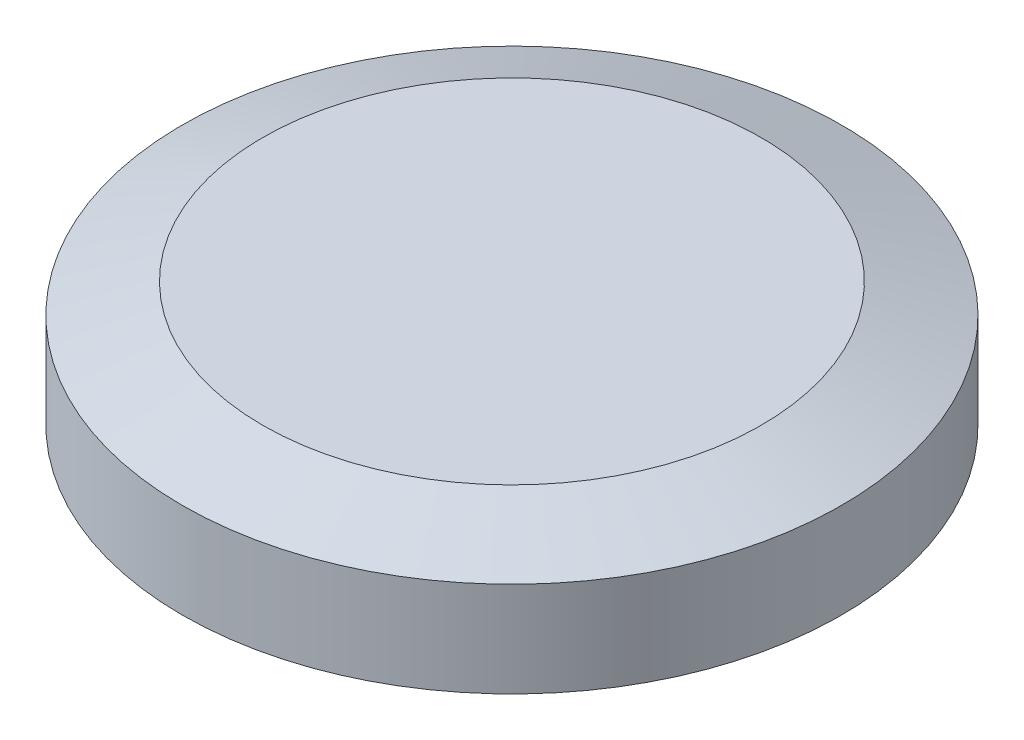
ISO-10303-21;
HEADER;
FILE_DESCRIPTION(('STEP AP214'),'2;1');
FILE_NAME('part.step','',(''),(''),'','','');
FILE_SCHEMA(('AUTOMOTIVE_DESIGN { 1 0 10303 214 1 1 1 1 }'));
ENDSEC;
DATA;
#1=APPLICATION_CONTEXT('core data for automotive mechanical design processes');
#2=APPLICATION_PROTOCOL_DEFINITION('international standard','automotive_design',2000,#1);
#3=PRODUCT_CONTEXT('',#1,'mechanical');
#4=PRODUCT('Part','Part','',(#3));
#5=PRODUCT_RELATED_PRODUCT_CATEGORY('part','',(#4));
#6=PRODUCT_DEFINITION_FORMATION('','',#4);
#7=PRODUCT_DEFINITION_CONTEXT('part definition',#1,'design');
#8=PRODUCT_DEFINITION('design','',#6,#7);
#9=PRODUCT_DEFINITION_SHAPE('','',#8);
#10=(LENGTH_UNIT() NAMED_UNIT(*) SI_UNIT(.MILLI.,.METRE.));
#11=(NAMED_UNIT(*) PLANE_ANGLE_UNIT() SI_UNIT($,.RADIAN.));
#12=(NAMED_UNIT(*) SI_UNIT($,.STERADIAN.) SOLID_ANGLE_UNIT());
#13=UNCERTAINTY_MEASURE_WITH_UNIT(LENGTH_MEASURE(1.E-05),#10,'distance_accuracy_value','');
#14=(GEOMETRIC_REPRESENTATION_CONTEXT(3) GLOBAL_UNCERTAINTY_ASSIGNED_CONTEXT((#13)) GLOBAL_UNIT_ASSIGNED_CONTEXT((#10,
#11,#12)) REPRESENTATION_CONTEXT('',''));
#15=CARTESIAN_POINT('',(0.,0.,0.));
#16=DIRECTION('',(0.,0.,1.));
#17=DIRECTION('',(1.,0.,0.));
#18=AXIS2_PLACEMENT_3D('',#15,#16,#17);
#19=CARTESIAN_POINT('',(0.,0.,0.));
#20=DIRECTION('',(0.,-1.,0.));
#21=DIRECTION('',(0.,0.,-1.));
#22=AXIS2_PLACEMENT_3D('',#19,#20,#21);
#23=PLANE('',#22);
#24=CARTESIAN_POINT('',(0.,0.,0.));
#25=DIRECTION('',(0.,1.,0.));
#26=DIRECTION('',(0.,0.,1.));
#27=AXIS2_PLACEMENT_3D('',#24,#25,#26);
#28=CIRCLE('',#27,8.27586676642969);
#29=CARTESIAN_POINT('',(0.,0.,8.27586676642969));
#30=VERTEX_POINT('',#29);
#31=EDGE_CURVE('E10',#30,#30,#28,.T.);
#32=ORIENTED_EDGE('',*,*,#31,.F.);
#33=EDGE_LOOP('',(#32));
#34=FACE_BOUND('',#33,.T.);
#35=ADVANCED_FACE('F31',(#34),#23,.T.);
#36=CARTESIAN_POINT('',(0.,0.787399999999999,0.));
#37=DIRECTION('',(0.,1.,0.));
#38=DIRECTION('',(0.,0.,1.));
#39=AXIS2_PLACEMENT_3D('',#36,#37,#38);
#40=TOROIDAL_SURFACE('',#39,8.27586676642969,0.787399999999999);
#41=ORIENTED_EDGE('',*,*,#31,.T.);
#42=EDGE_LOOP('',(#41));
#43=FACE_BOUND('',#42,.T.);
#44=CARTESIAN_POINT('',(0.,0.230624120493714,0.));
#45=DIRECTION('',(0.,1.,0.));
#46=DIRECTION('',(0.,0.,1.));
#47=AXIS2_PLACEMENT_3D('',#44,#45,#46);
#48=CIRCLE('',#47,8.83264264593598);
#49=CARTESIAN_POINT('',(0.,0.230624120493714,8.83264264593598));
#50=VERTEX_POINT('',#49);
#51=EDGE_CURVE('E37',#50,#50,#48,.T.);
#52=ORIENTED_EDGE('',*,*,#51,.F.);
#53=EDGE_LOOP('',(#52));
#54=FACE_BOUND('',#53,.T.);
#55=ADVANCED_FACE('F79',(#43,#54),#40,.T.);
#56=CARTESIAN_POINT('',(0.,0.982285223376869,0.));
#57=DIRECTION('',(0.,1.,0.));
#58=DIRECTION('',(0.,0.,1.));
#59=AXIS2_PLACEMENT_3D('',#56,#57,#58);
#60=CONICAL_SURFACE('',#59,9.58430374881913,0.785398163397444);
#61=ORIENTED_EDGE('',*,*,#51,.T.);
#62=EDGE_LOOP('',(#61));
#63=FACE_BOUND('',#62,.T.);
#64=CARTESIAN_POINT('',(0.,0.982285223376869,0.));
#65=DIRECTION('',(0.,1.,0.));
#66=DIRECTION('',(0.,0.,1.));
#67=AXIS2_PLACEMENT_3D('',#64,#65,#66);
#68=CIRCLE('',#67,9.58430374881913);
#69=CARTESIAN_POINT('',(0.,0.982285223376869,9.58430374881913));
#70=VERTEX_POINT('',#69);
#71=EDGE_CURVE('E41',#70,#70,#68,.T.);
#72=ORIENTED_EDGE('',*,*,#71,.F.);
#73=EDGE_LOOP('',(#72));
#74=FACE_BOUND('',#73,.T.);
#75=ADVANCED_FACE('F84',(#63,#74),#60,.T.);
#76=CARTESIAN_POINT('',(0.,0.431799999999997,0.));
#77=DIRECTION('',(0.,1.,0.));
#78=DIRECTION('',(0.,0.,1.));
#79=AXIS2_PLACEMENT_3D('',#76,#77,#78);
#80=TOROIDAL_SURFACE('',#79,10.1473,0.7874);
#81=ORIENTED_EDGE('',*,*,#71,.T.);
#82=EDGE_LOOP('',(#81));
#83=FACE_BOUND('',#82,.T.);
#84=CARTESIAN_POINT('',(0.,0.572649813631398,0.));
#85=DIRECTION('',(0.,1.,0.));
#86=DIRECTION('',(0.,0.,1.));
#87=AXIS2_PLACEMENT_3D('',#84,#85,#86);
#88=CIRCLE('',#87,10.922);
#89=CARTESIAN_POINT('',(0.,0.572649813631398,10.922));
#90=VERTEX_POINT('',#89);
#91=EDGE_CURVE('E45',#90,#90,#88,.T.);
#92=ORIENTED_EDGE('',*,*,#91,.F.);
#93=EDGE_LOOP('',(#92));
#94=FACE_BOUND('',#93,.T.);
#95=ADVANCED_FACE('F88',(#83,#94),#80,.F.);
#96=CARTESIAN_POINT('',(0.,3.8608,0.));
#97=DIRECTION('',(0.,1.,0.));
#98=DIRECTION('',(0.,0.,1.));
#99=AXIS2_PLACEMENT_3D('',#96,#97,#98);
#100=CYLINDRICAL_SURFACE('',#99,10.922);
#101=ORIENTED_EDGE('',*,*,#91,.T.);
#102=EDGE_LOOP('',(#101));
#103=FACE_BOUND('',#102,.T.);
#104=CARTESIAN_POINT('',(0.,-0.889000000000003,0.));
#105=DIRECTION('',(0.,1.,0.));
#106=DIRECTION('',(0.,0.,1.));
#107=AXIS2_PLACEMENT_3D('',#104,#105,#106);
#108=CIRCLE('',#107,10.922);
#109=CARTESIAN_POINT('',(0.,-0.889000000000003,10.922));
#110=VERTEX_POINT('',#109);
#111=EDGE_CURVE('E50',#110,#110,#108,.T.);
#112=ORIENTED_EDGE('',*,*,#111,.F.);
#113=EDGE_LOOP('',(#112));
#114=FACE_BOUND('',#113,.T.);
#115=ADVANCED_FACE('F94',(#103,#114),#100,.F.);
#116=CARTESIAN_POINT('',(-12.5984,-0.889000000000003,0.));
#117=DIRECTION('',(0.,-1.,0.));
#118=DIRECTION('',(0.,0.,-1.));
#119=AXIS2_PLACEMENT_3D('',#116,#117,#118);
#120=PLANE('',#119);
#121=ORIENTED_EDGE('',*,*,#111,.T.);
#122=EDGE_LOOP('',(#121));
#123=FACE_BOUND('',#122,.T.);
#124=CARTESIAN_POINT('',(0.,-0.889000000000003,0.));
#125=DIRECTION('',(0.,1.,0.));
#126=DIRECTION('',(0.,0.,1.));
#127=AXIS2_PLACEMENT_3D('',#124,#125,#126);
#128=CIRCLE('',#127,12.5984);
#129=CARTESIAN_POINT('',(0.,-0.889000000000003,12.5984));
#130=VERTEX_POINT('',#129);
#131=EDGE_CURVE('E53',#130,#130,#128,.T.);
#132=ORIENTED_EDGE('',*,*,#131,.F.);
#133=EDGE_LOOP('',(#132));
#134=FACE_BOUND('',#133,.T.);
#135=ADVANCED_FACE('F75',(#123,#134),#120,.T.);
#136=CARTESIAN_POINT('',(0.,3.8608,0.));
#137=DIRECTION('',(0.,1.,0.));
#138=DIRECTION('',(0.,0.,1.));
#139=AXIS2_PLACEMENT_3D('',#136,#137,#138);
#140=CYLINDRICAL_SURFACE('',#139,12.5984);
#141=ORIENTED_EDGE('',*,*,#131,.T.);
#142=EDGE_LOOP('',(#141));
#143=FACE_BOUND('',#142,.T.);
#144=CARTESIAN_POINT('',(0.,2.7432,0.));
#145=DIRECTION('',(0.,1.,0.));
#146=DIRECTION('',(0.,0.,1.));
#147=AXIS2_PLACEMENT_3D('',#144,#145,#146);
#148=CIRCLE('',#147,12.5984);
#149=CARTESIAN_POINT('',(0.,2.7432,12.5984));
#150=VERTEX_POINT('',#149);
#151=EDGE_CURVE('E56',#150,#150,#148,.T.);
#152=ORIENTED_EDGE('',*,*,#151,.F.);
#153=EDGE_LOOP('',(#152));
#154=FACE_BOUND('',#153,.T.);
#155=ADVANCED_FACE('F67',(#143,#154),#140,.T.);
#156=CARTESIAN_POINT('',(0.,3.8608,0.));
#157=DIRECTION('',(0.,-1.,0.));
#158=DIRECTION('',(0.,0.,-1.));
#159=AXIS2_PLACEMENT_3D('',#156,#157,#158);
#160=CONICAL_SURFACE('',#159,9.52781923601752,1.22173047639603);
#161=ORIENTED_EDGE('',*,*,#151,.T.);
#162=EDGE_LOOP('',(#161));
#163=FACE_BOUND('',#162,.T.);
#164=CARTESIAN_POINT('',(0.,3.8608,0.));
#165=DIRECTION('',(0.,1.,0.));
#166=DIRECTION('',(0.,0.,1.));
#167=AXIS2_PLACEMENT_3D('',#164,#165,#166);
#168=CIRCLE('',#167,9.52781923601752);
#169=CARTESIAN_POINT('',(0.,3.8608,9.52781923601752));
#170=VERTEX_POINT('',#169);
#171=EDGE_CURVE('E59',#170,#170,#168,.T.);
#172=ORIENTED_EDGE('',*,*,#171,.F.);
#173=EDGE_LOOP('',(#172));
#174=FACE_BOUND('',#173,.T.);
#175=ADVANCED_FACE('F65',(#163,#174),#160,.T.);
#176=CARTESIAN_POINT('',(-9.52781923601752,3.8608,0.));
#177=DIRECTION('',(0.,1.,0.));
#178=DIRECTION('',(0.,0.,1.));
#179=AXIS2_PLACEMENT_3D('',#176,#177,#178);
#180=PLANE('',#179);
#181=ORIENTED_EDGE('',*,*,#171,.T.);
#182=EDGE_LOOP('',(#181));
#183=FACE_BOUND('',#182,.T.);
#184=ADVANCED_FACE('F63',(#183),#180,.T.);
#185=CLOSED_SHELL('',(#35,#55,#75,#95,#115,#135,#155,#175,#184));
#186=MANIFOLD_SOLID_BREP('B2',#185);
#187=ADVANCED_BREP_SHAPE_REPRESENTATION('',(#18,#186),#14);
#188=SHAPE_DEFINITION_REPRESENTATION(#9,#187);
ENDSEC;
END-ISO-10303-21;
